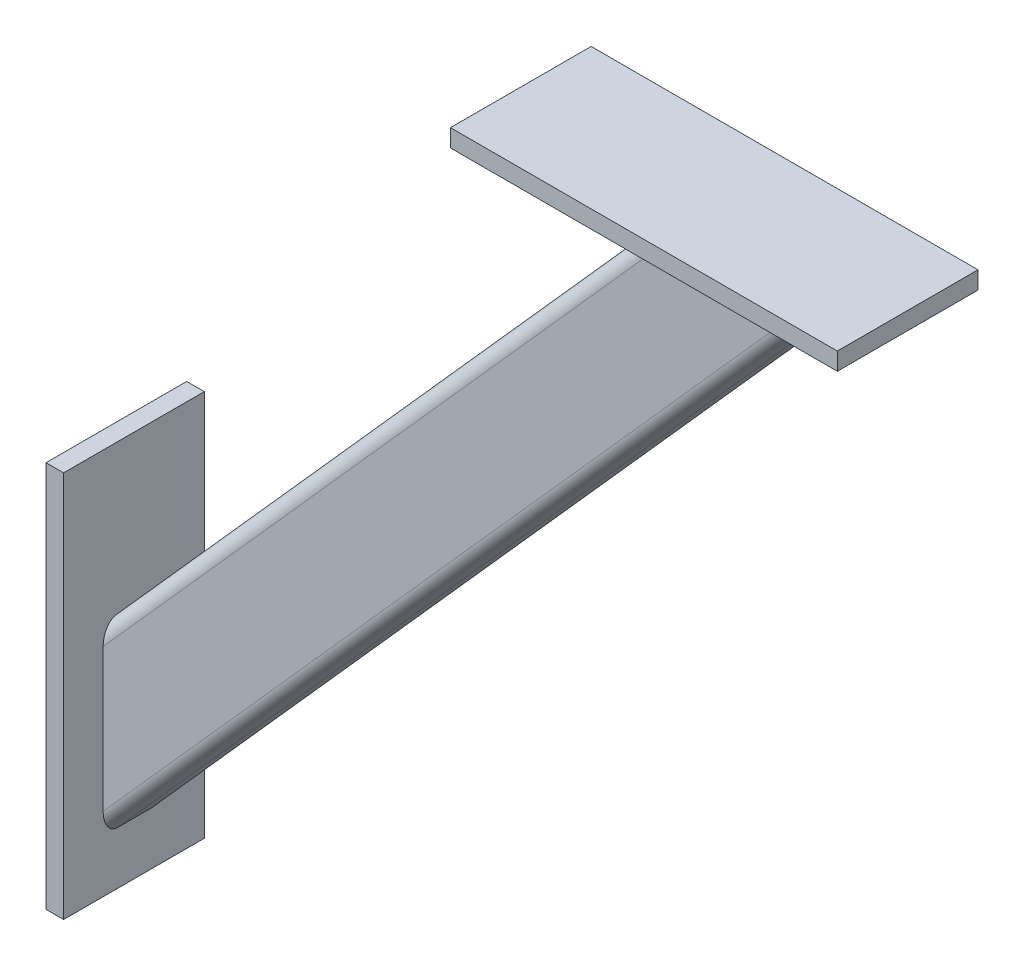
from build123d import *

# Parameters (mm, degrees)
ESQUISSE2_W                        = 10
ESQUISSE2_H                        = 220
EXTRU_MINCE1_DEPTH                 = 40
ESQUISSE2_W_2                      = 220
ESQUISSE2_H_2                      = 10
EXTRU_MINCE1_2_DEPTH               = 40
TUBE_RECTANGULAIRE_70X35X3_1_DEPTH = 674.158904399
ENL_V_MAT_EXTRU_1_DEPTH            = 674.869423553
ENL_V_MAT_EXTRU_1_DEPTH_BACK       = 674.869423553
ESQUISSE8_OUTSIDE_W                = 663.734
ESQUISSE8_OUTSIDE_H                = 714.952
ESQUISSE8_OUTSIDE_W_2              = 440
ESQUISSE8_OUTSIDE_H_2              = 490


with BuildPart() as part:
    # Esquisse2 → Extru.-Mince1 (new, symmetric)
    with BuildSketch(Plane.XY):
        with Locations((5, -390)):
            Rectangle(ESQUISSE2_W, ESQUISSE2_H)
    extrude(amount=EXTRU_MINCE1_DEPTH, both=True)


with BuildPart() as body_2:
    # Esquisse2 → Extru.-Mince1 2 (new, symmetric)
    with BuildSketch(Plane.XY):
        with Locations((340, -5)):
            Rectangle(ESQUISSE2_W_2, ESQUISSE2_H_2)
    extrude(amount=EXTRU_MINCE1_2_DEPTH, both=True)


with BuildPart() as body_3:
    # tube 70x35x3 → Tube rectangulaire _70X35X3_1 (new body)
    with BuildSketch(Plane(origin=(415.29693775, 37.325663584, 0), x_dir=(0.7465132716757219, -0.6653705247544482, 0), z_dir=(-0.6653705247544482, -0.7465132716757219, 0))):
        with BuildLine():
            Line((-27, 17.5), (27, 17.5))
            ThreePointArc((27, 17.5), (32.656854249, 15.156854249), (35, 9.5))
            Line((35, 9.5), (35, -9.5))
            ThreePointArc((35, -9.5), (32.656854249, -15.156854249), (27, -17.5))
            Line((27, -17.5), (-27, -17.5))
            ThreePointArc((-27, -17.5), (-32.656854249, -15.156854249), (-35, -9.5))
            Line((-35, -9.5), (-35, 9.5))
            ThreePointArc((-35, 9.5), (-32.656854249, 15.156854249), (-27, 17.5))
        make_face()
        with BuildLine():
            Line((-27, 13.5), (27, 13.5))
            ThreePointArc((27, 13.5), (29.828427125, 12.328427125), (31, 9.5))
            Line((31, 9.5), (31, -9.5))
            ThreePointArc((31, -9.5), (29.828427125, -12.328427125), (27, -13.5))
            Line((27, -13.5), (-27, -13.5))
            ThreePointArc((-27, -13.5), (-29.828427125, -12.328427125), (-31, -9.5))
            Line((-31, -9.5), (-31, 9.5))
            ThreePointArc((-31, 9.5), (-29.828427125, 12.328427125), (-27, 13.5))
        make_face(mode=Mode.SUBTRACT)
    extrude(amount=TUBE_RECTANGULAIRE_70X35X3_1_DEPTH)

    # Esquisse8 outside → Enl_v. mat.-Extru.1 (cut, two sides: drawn at the far end of the back side and taken through both)
    with BuildSketch(Plane.XY.offset(-ENL_V_MAT_EXTRU_1_DEPTH_BACK)):
        with Locations((195.302, -219.693)):
            Rectangle(ESQUISSE8_OUTSIDE_W, ESQUISSE8_OUTSIDE_H)
        with Locations((230, -255)):
            Rectangle(ESQUISSE8_OUTSIDE_W_2, ESQUISSE8_OUTSIDE_H_2, mode=Mode.SUBTRACT)
    extrude(amount=ENL_V_MAT_EXTRU_1_DEPTH + ENL_V_MAT_EXTRU_1_DEPTH_BACK, mode=Mode.SUBTRACT)


solid = Compound([part.part, body_2.part, body_3.part])
